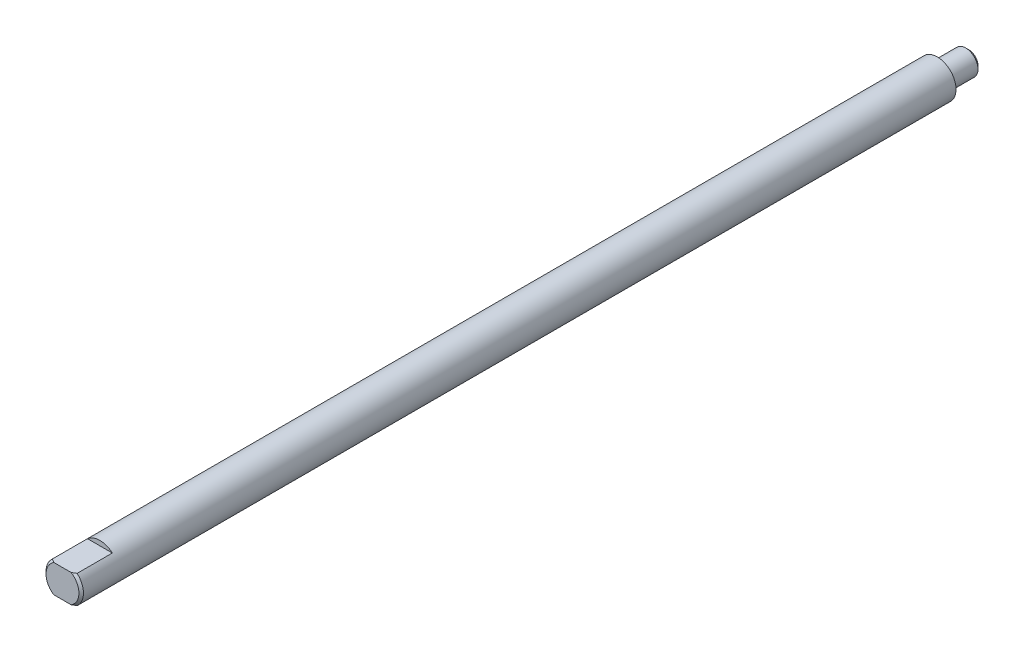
from build123d import *

# Parameters (mm, degrees)
SKETCH2_W          = 6.35
SKETCH2_H          = 0.8
CUT_EXTRUDE1_DEPTH = 5


with BuildPart() as part:
    # Sketch1 → Revolve1 (revolve)
    with BuildSketch(Plane(origin=(0, 0, 0), x_dir=(0, 0, -1), z_dir=(1, 0, 0)), mode=Mode.PRIVATE) as revolve1_sk:
        Polygon((149.6528, 1.5728), (149.1428, 2.0828), (144.3228, 2.0828), (144.3228, 3.175), (-3.684, 3.175), (-4.064, 2.79), (-4.064, 0), (149.6528, 0), align=None)
    revolve(revolve1_sk.sketch.rotate(Axis((0, 0, 4.064), (0, 0, -1)), 90), axis=Axis((0, 0, 4.064), (0, 0, -1)))

    # Sketch2 → Cut-Extrude1 (cut, symmetric)
    with BuildSketch(Plane(origin=(0, 0, 0), x_dir=(0, 0, -1), z_dir=(1, 0, 0))):
        with Locations((-0.889, 2.775)):
            Rectangle(SKETCH2_W, SKETCH2_H)
        with Locations((-0.889, -2.775)):
            Rectangle(SKETCH2_W, SKETCH2_H)
    extrude(amount=CUT_EXTRUDE1_DEPTH, both=True, mode=Mode.SUBTRACT)


solid = part.part
